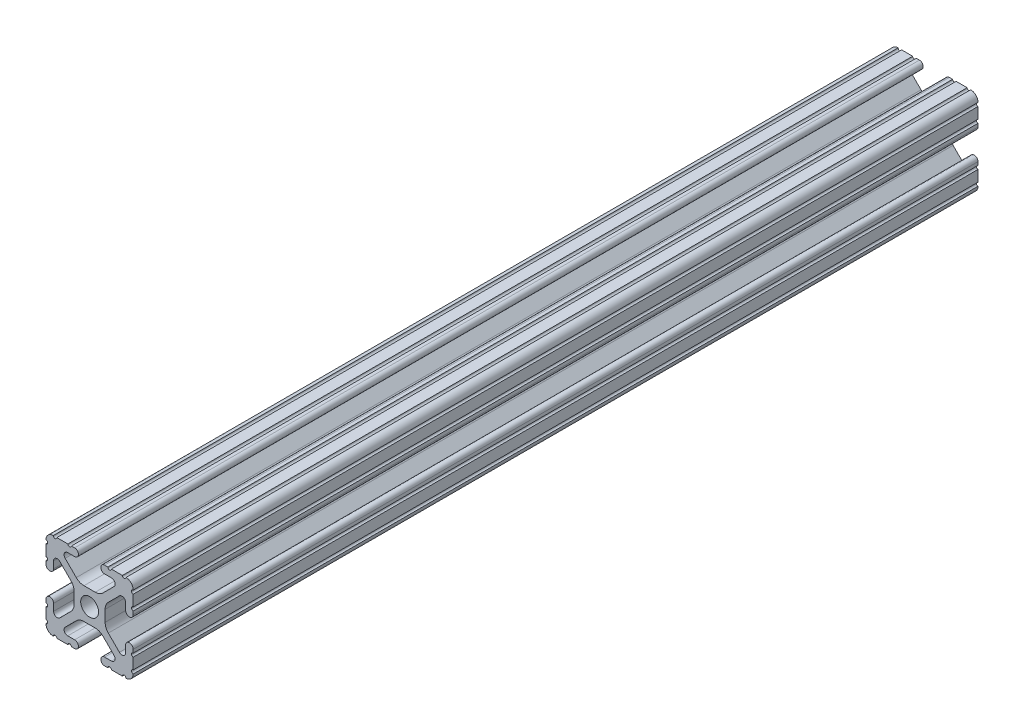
from build123d import *

# Parameters (mm, degrees)
SKETCH1_R      = 2.6035
EXTRUDE1_DEPTH = 246


with BuildPart() as part:
    # Sketch1 → Extrude1 (new body)
    with BuildSketch(Plane.XY):
        with BuildLine():
            Line((10.5918, 12.7), (10.5664, 12.7))
            ThreePointArc((10.5664, 12.7), (10.0584, 12.192), (9.5504, 12.7))
            Line((9.5504, 12.7), (6.3246, 12.7))
            ThreePointArc((6.3246, 12.7), (5.8166, 12.192), (5.3086, 12.7))
            Line((5.3086, 12.7), (4.3561, 12.7))
            ThreePointArc((4.3561, 12.7), (3.2512, 11.5951), (4.3561, 10.4902))
            Line((4.3561, 10.4902), (6.370083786, 10.4902))
            ThreePointArc((6.370083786, 10.4902), (7.348856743, 9.836204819), (7.119204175, 8.681663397))
            Line((7.119204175, 8.681663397), (3.88464389, 5.447103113))
            ThreePointArc((3.88464389, 5.447103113), (2.854599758, 4.758849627), (1.63957986, 4.517167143))
            Line((1.63957986, 4.517167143), (-1.63957986, 4.517167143))
            ThreePointArc((-1.63957986, 4.517167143), (-2.854599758, 4.758849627), (-3.88464389, 5.447103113))
            Line((-3.88464389, 5.447103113), (-7.119204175, 8.681663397))
            ThreePointArc((-7.119204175, 8.681663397), (-7.348856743, 9.836204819), (-6.370083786, 10.4902))
            Line((-6.370083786, 10.4902), (-4.3561, 10.4902))
            ThreePointArc((-4.3561, 10.4902), (-3.2512, 11.5951), (-4.3561, 12.7))
            Line((-4.3561, 12.7), (-5.3086, 12.7))
            ThreePointArc((-5.3086, 12.7), (-5.8166, 12.192), (-6.3246, 12.7))
            Line((-6.3246, 12.7), (-9.5504, 12.7))
            ThreePointArc((-9.5504, 12.7), (-10.0584, 12.192), (-10.5664, 12.7))
            Line((-10.5664, 12.7), (-10.5918, 12.7))
            ThreePointArc((-10.5918, 12.7), (-12.082522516, 12.082522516), (-12.7, 10.5918))
            Line((-12.7, 10.5918), (-12.7, 10.5664))
            ThreePointArc((-12.7, 10.5664), (-12.192, 10.0584), (-12.7, 9.5504))
            Line((-12.7, 9.5504), (-12.7, 6.3246))
            ThreePointArc((-12.7, 6.3246), (-12.192, 5.8166), (-12.7, 5.3086))
            Line((-12.7, 5.3086), (-12.7, 4.3561))
            ThreePointArc((-12.7, 4.3561), (-11.5951, 3.2512), (-10.4902, 4.3561))
            Line((-10.4902, 4.3561), (-10.4902, 6.370083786))
            ThreePointArc((-10.4902, 6.370083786), (-9.836204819, 7.348856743), (-8.681663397, 7.119204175))
            Line((-8.681663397, 7.119204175), (-5.447103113, 3.88464389))
            ThreePointArc((-5.447103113, 3.88464389), (-4.758849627, 2.854599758), (-4.517167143, 1.63957986))
            Line((-4.517167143, 1.63957986), (-4.517167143, -1.63957986))
            ThreePointArc((-4.517167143, -1.63957986), (-4.758849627, -2.854599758), (-5.447103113, -3.88464389))
            Line((-5.447103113, -3.88464389), (-8.681663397, -7.119204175))
            ThreePointArc((-8.681663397, -7.119204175), (-9.836204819, -7.348856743), (-10.4902, -6.370083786))
            Line((-10.4902, -6.370083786), (-10.4902, -4.3561))
            ThreePointArc((-10.4902, -4.3561), (-11.5951, -3.2512), (-12.7, -4.3561))
            Line((-12.7, -4.3561), (-12.7, -5.3086))
            ThreePointArc((-12.7, -5.3086), (-12.192, -5.8166), (-12.7, -6.3246))
            Line((-12.7, -6.3246), (-12.7, -9.5504))
            ThreePointArc((-12.7, -9.5504), (-12.192, -10.0584), (-12.7, -10.5664))
            Line((-12.7, -10.5664), (-12.7, -10.5918))
            ThreePointArc((-12.7, -10.5918), (-12.082522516, -12.082522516), (-10.5918, -12.7))
            Line((-10.5918, -12.7), (-10.5664, -12.7))
            ThreePointArc((-10.5664, -12.7), (-10.0584, -12.192), (-9.5504, -12.7))
            Line((-9.5504, -12.7), (-6.3246, -12.7))
            ThreePointArc((-6.3246, -12.7), (-5.8166, -12.192), (-5.3086, -12.7))
            Line((-5.3086, -12.7), (-4.3561, -12.7))
            ThreePointArc((-4.3561, -12.7), (-3.2512, -11.5951), (-4.3561, -10.4902))
            Line((-4.3561, -10.4902), (-6.370083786, -10.4902))
            ThreePointArc((-6.370083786, -10.4902), (-7.348856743, -9.836204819), (-7.119204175, -8.681663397))
            Line((-7.119204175, -8.681663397), (-3.88464389, -5.447103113))
            ThreePointArc((-3.88464389, -5.447103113), (-2.854599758, -4.758849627), (-1.63957986, -4.517167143))
            Line((-1.63957986, -4.517167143), (1.63957986, -4.517167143))
            ThreePointArc((1.63957986, -4.517167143), (2.854599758, -4.758849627), (3.88464389, -5.447103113))
            Line((3.88464389, -5.447103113), (7.119204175, -8.681663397))
            ThreePointArc((7.119204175, -8.681663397), (7.348856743, -9.836204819), (6.370083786, -10.4902))
            Line((6.370083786, -10.4902), (4.3561, -10.4902))
            ThreePointArc((4.3561, -10.4902), (3.2512, -11.5951), (4.3561, -12.7))
            Line((4.3561, -12.7), (5.3086, -12.7))
            ThreePointArc((5.3086, -12.7), (5.8166, -12.192), (6.3246, -12.7))
            Line((6.3246, -12.7), (9.5504, -12.7))
            ThreePointArc((9.5504, -12.7), (10.0584, -12.192), (10.5664, -12.7))
            Line((10.5664, -12.7), (10.5918, -12.7))
            ThreePointArc((10.5918, -12.7), (12.082522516, -12.082522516), (12.7, -10.5918))
            Line((12.7, -10.5918), (12.7, -10.5664))
            ThreePointArc((12.7, -10.5664), (12.192, -10.0584), (12.7, -9.5504))
            Line((12.7, -9.5504), (12.7, -6.3246))
            ThreePointArc((12.7, -6.3246), (12.192, -5.8166), (12.7, -5.3086))
            Line((12.7, -5.3086), (12.7, -4.3561))
            ThreePointArc((12.7, -4.3561), (11.5951, -3.2512), (10.4902, -4.3561))
            Line((10.4902, -4.3561), (10.4902, -6.370083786))
            ThreePointArc((10.4902, -6.370083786), (9.836204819, -7.348856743), (8.681663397, -7.119204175))
            Line((8.681663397, -7.119204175), (5.447103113, -3.88464389))
            ThreePointArc((5.447103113, -3.88464389), (4.758849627, -2.854599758), (4.517167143, -1.63957986))
            Line((4.517167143, -1.63957986), (4.517167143, 1.63957986))
            ThreePointArc((4.517167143, 1.63957986), (4.758849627, 2.854599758), (5.447103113, 3.88464389))
            Line((5.447103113, 3.88464389), (8.681663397, 7.119204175))
            ThreePointArc((8.681663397, 7.119204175), (9.836204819, 7.348856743), (10.4902, 6.370083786))
            Line((10.4902, 6.370083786), (10.4902, 4.3561))
            ThreePointArc((10.4902, 4.3561), (11.5951, 3.2512), (12.7, 4.3561))
            Line((12.7, 4.3561), (12.7, 5.3086))
            ThreePointArc((12.7, 5.3086), (12.192, 5.8166), (12.7, 6.3246))
            Line((12.7, 6.3246), (12.7, 9.5504))
            ThreePointArc((12.7, 9.5504), (12.192, 10.0584), (12.7, 10.5664))
            Line((12.7, 10.5664), (12.7, 10.5918))
            ThreePointArc((12.7, 10.5918), (12.082522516, 12.082522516), (10.5918, 12.7))
        make_face()
        Circle(SKETCH1_R, mode=Mode.SUBTRACT)
    extrude(amount=-EXTRUDE1_DEPTH)


solid = part.part
